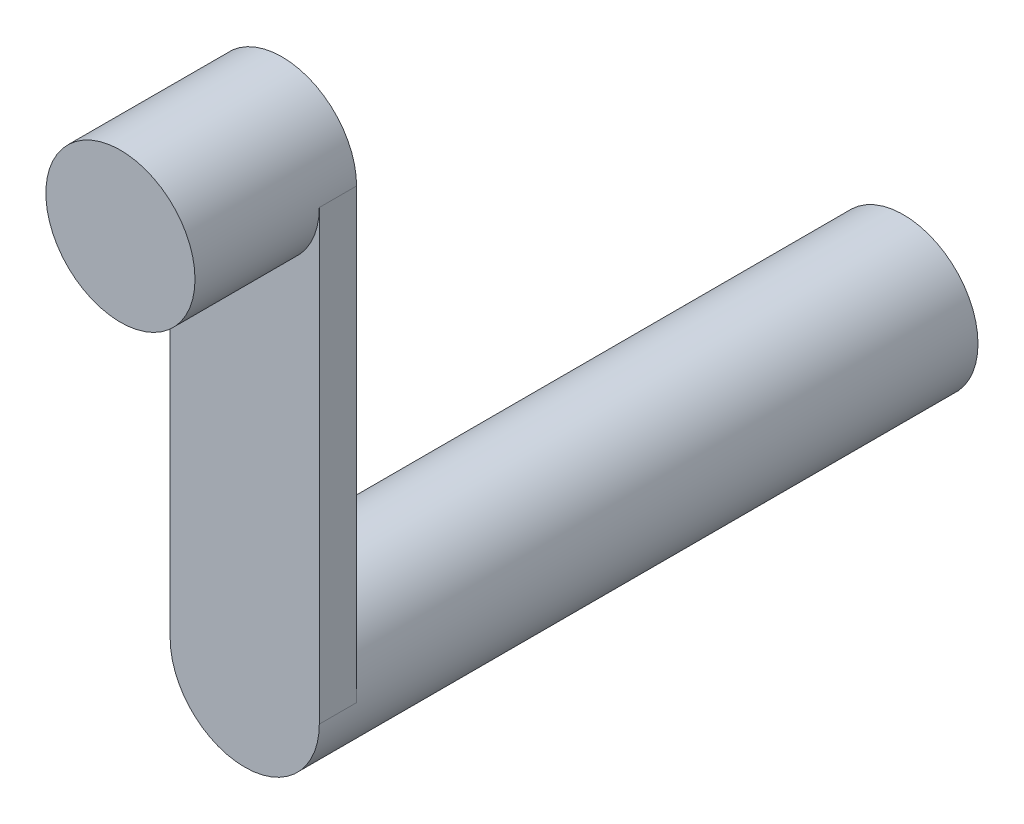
ISO-10303-21;
HEADER;
FILE_DESCRIPTION(('STEP AP214'),'2;1');
FILE_NAME('part.step','',(''),(''),'','','');
FILE_SCHEMA(('AUTOMOTIVE_DESIGN { 1 0 10303 214 1 1 1 1 }'));
ENDSEC;
DATA;
#1=APPLICATION_CONTEXT('core data for automotive mechanical design processes');
#2=APPLICATION_PROTOCOL_DEFINITION('international standard','automotive_design',2000,#1);
#3=PRODUCT_CONTEXT('',#1,'mechanical');
#4=PRODUCT('Part','Part','',(#3));
#5=PRODUCT_RELATED_PRODUCT_CATEGORY('part','',(#4));
#6=PRODUCT_DEFINITION_FORMATION('','',#4);
#7=PRODUCT_DEFINITION_CONTEXT('part definition',#1,'design');
#8=PRODUCT_DEFINITION('design','',#6,#7);
#9=PRODUCT_DEFINITION_SHAPE('','',#8);
#10=(LENGTH_UNIT() NAMED_UNIT(*) SI_UNIT(.MILLI.,.METRE.));
#11=(NAMED_UNIT(*) PLANE_ANGLE_UNIT() SI_UNIT($,.RADIAN.));
#12=(NAMED_UNIT(*) SI_UNIT($,.STERADIAN.) SOLID_ANGLE_UNIT());
#13=UNCERTAINTY_MEASURE_WITH_UNIT(LENGTH_MEASURE(1.E-05),#10,'distance_accuracy_value','');
#14=(GEOMETRIC_REPRESENTATION_CONTEXT(3) GLOBAL_UNCERTAINTY_ASSIGNED_CONTEXT((#13)) GLOBAL_UNIT_ASSIGNED_CONTEXT((#10,
#11,#12)) REPRESENTATION_CONTEXT('',''));
#15=CARTESIAN_POINT('',(0.,0.,0.));
#16=DIRECTION('',(0.,0.,1.));
#17=DIRECTION('',(1.,0.,0.));
#18=AXIS2_PLACEMENT_3D('',#15,#16,#17);
#19=CARTESIAN_POINT('',(0.,0.,50.));
#20=DIRECTION('',(0.,0.,-1.));
#21=DIRECTION('',(-1.,0.,0.));
#22=AXIS2_PLACEMENT_3D('',#19,#20,#21);
#23=CYLINDRICAL_SURFACE('',#22,6.);
#24=CARTESIAN_POINT('',(0.,0.,50.));
#25=DIRECTION('',(0.,0.,1.));
#26=DIRECTION('',(1.,0.,0.));
#27=AXIS2_PLACEMENT_3D('',#24,#25,#26);
#28=CIRCLE('',#27,6.);
#29=CARTESIAN_POINT('',(6.,0.,50.));
#30=VERTEX_POINT('',#29);
#31=CARTESIAN_POINT('',(-6.,0.,50.));
#32=VERTEX_POINT('',#31);
#33=EDGE_CURVE('E44',#30,#32,#28,.T.);
#34=ORIENTED_EDGE('',*,*,#33,.F.);
#35=DIRECTION('',(0.,0.,-1.));
#36=VECTOR('',#35,1.);
#37=CARTESIAN_POINT('',(6.,0.,53.));
#38=LINE('',#37,#36);
#39=CARTESIAN_POINT('',(6.,0.,53.));
#40=VERTEX_POINT('',#39);
#41=EDGE_CURVE('E86',#40,#30,#38,.T.);
#42=ORIENTED_EDGE('',*,*,#41,.F.);
#43=CARTESIAN_POINT('',(0.,0.,53.));
#44=DIRECTION('',(0.,0.,1.));
#45=DIRECTION('',(1.,0.,0.));
#46=AXIS2_PLACEMENT_3D('',#43,#44,#45);
#47=CIRCLE('',#46,6.);
#48=CARTESIAN_POINT('',(-6.,0.,53.));
#49=VERTEX_POINT('',#48);
#50=EDGE_CURVE('E59',#49,#40,#47,.T.);
#51=ORIENTED_EDGE('',*,*,#50,.F.);
#52=DIRECTION('',(0.,0.,-1.));
#53=VECTOR('',#52,1.);
#54=CARTESIAN_POINT('',(-6.,0.,53.));
#55=LINE('',#54,#53);
#56=EDGE_CURVE('E99',#49,#32,#55,.T.);
#57=ORIENTED_EDGE('',*,*,#56,.T.);
#58=EDGE_LOOP('',(#34,#42,#51,#57));
#59=FACE_BOUND('',#58,.T.);
#60=CARTESIAN_POINT('',(0.,0.,0.));
#61=DIRECTION('',(0.,0.,1.));
#62=DIRECTION('',(1.,0.,0.));
#63=AXIS2_PLACEMENT_3D('',#60,#61,#62);
#64=CIRCLE('',#63,6.);
#65=CARTESIAN_POINT('',(6.,0.,0.));
#66=VERTEX_POINT('',#65);
#67=EDGE_CURVE('E98',#66,#66,#64,.T.);
#68=ORIENTED_EDGE('',*,*,#67,.T.);
#69=EDGE_LOOP('',(#68));
#70=FACE_BOUND('',#69,.T.);
#71=ADVANCED_FACE('F36',(#59,#70),#23,.T.);
#72=CARTESIAN_POINT('',(0.,0.,0.));
#73=DIRECTION('',(0.,0.,1.));
#74=DIRECTION('',(1.,0.,0.));
#75=AXIS2_PLACEMENT_3D('',#72,#73,#74);
#76=PLANE('',#75);
#77=ORIENTED_EDGE('',*,*,#67,.F.);
#78=EDGE_LOOP('',(#77));
#79=FACE_BOUND('',#78,.T.);
#80=ADVANCED_FACE('F147',(#79),#76,.F.);
#81=CARTESIAN_POINT('',(0.,36.,50.));
#82=DIRECTION('',(0.,0.,1.));
#83=DIRECTION('',(1.,0.,0.));
#84=AXIS2_PLACEMENT_3D('',#81,#82,#83);
#85=PLANE('',#84);
#86=DIRECTION('',(0.,1.,0.));
#87=VECTOR('',#86,1.);
#88=CARTESIAN_POINT('',(6.,36.,50.));
#89=LINE('',#88,#87);
#90=CARTESIAN_POINT('',(6.,36.,50.));
#91=VERTEX_POINT('',#90);
#92=EDGE_CURVE('E82',#30,#91,#89,.T.);
#93=ORIENTED_EDGE('',*,*,#92,.F.);
#94=ORIENTED_EDGE('',*,*,#33,.T.);
#95=DIRECTION('',(0.,-1.,0.));
#96=VECTOR('',#95,1.);
#97=CARTESIAN_POINT('',(-6.,36.,50.));
#98=LINE('',#97,#96);
#99=CARTESIAN_POINT('',(-6.,36.,50.));
#100=VERTEX_POINT('',#99);
#101=EDGE_CURVE('E120',#100,#32,#98,.T.);
#102=ORIENTED_EDGE('',*,*,#101,.F.);
#103=CARTESIAN_POINT('',(0.,36.,50.));
#104=DIRECTION('',(0.,0.,1.));
#105=DIRECTION('',(1.,0.,0.));
#106=AXIS2_PLACEMENT_3D('',#103,#104,#105);
#107=CIRCLE('',#106,6.);
#108=EDGE_CURVE('E96',#91,#100,#107,.T.);
#109=ORIENTED_EDGE('',*,*,#108,.F.);
#110=EDGE_LOOP('',(#93,#94,#102,#109));
#111=FACE_BOUND('',#110,.T.);
#112=ADVANCED_FACE('F140',(#111),#85,.F.);
#113=CARTESIAN_POINT('',(0.,36.,53.));
#114=DIRECTION('',(0.,0.,-1.));
#115=DIRECTION('',(-1.,0.,0.));
#116=AXIS2_PLACEMENT_3D('',#113,#114,#115);
#117=CYLINDRICAL_SURFACE('',#116,6.);
#118=ORIENTED_EDGE('',*,*,#108,.T.);
#119=DIRECTION('',(0.,0.,-1.));
#120=VECTOR('',#119,1.);
#121=CARTESIAN_POINT('',(-6.,36.,53.));
#122=LINE('',#121,#120);
#123=CARTESIAN_POINT('',(-6.,36.,53.));
#124=VERTEX_POINT('',#123);
#125=EDGE_CURVE('E95',#124,#100,#122,.T.);
#126=ORIENTED_EDGE('',*,*,#125,.F.);
#127=CARTESIAN_POINT('',(0.,36.,53.));
#128=DIRECTION('',(0.,0.,1.));
#129=DIRECTION('',(1.,0.,0.));
#130=AXIS2_PLACEMENT_3D('',#127,#128,#129);
#131=CIRCLE('',#130,6.);
#132=CARTESIAN_POINT('',(6.,36.,53.));
#133=VERTEX_POINT('',#132);
#134=EDGE_CURVE('E11',#124,#133,#131,.T.);
#135=ORIENTED_EDGE('',*,*,#134,.T.);
#136=DIRECTION('',(0.,0.,-1.));
#137=VECTOR('',#136,1.);
#138=CARTESIAN_POINT('',(6.,36.,53.));
#139=LINE('',#138,#137);
#140=EDGE_CURVE('E78',#133,#91,#139,.T.);
#141=ORIENTED_EDGE('',*,*,#140,.T.);
#142=EDGE_LOOP('',(#118,#126,#135,#141));
#143=FACE_BOUND('',#142,.T.);
#144=CARTESIAN_POINT('',(0.,36.,63.));
#145=DIRECTION('',(0.,0.,1.));
#146=DIRECTION('',(1.,0.,0.));
#147=AXIS2_PLACEMENT_3D('',#144,#145,#146);
#148=CIRCLE('',#147,6.);
#149=CARTESIAN_POINT('',(6.,36.,63.));
#150=VERTEX_POINT('',#149);
#151=EDGE_CURVE('E133',#150,#150,#148,.T.);
#152=ORIENTED_EDGE('',*,*,#151,.F.);
#153=EDGE_LOOP('',(#152));
#154=FACE_BOUND('',#153,.T.);
#155=ADVANCED_FACE('F92',(#143,#154),#117,.T.);
#156=CARTESIAN_POINT('',(-6.,36.,53.));
#157=DIRECTION('',(1.,0.,0.));
#158=DIRECTION('',(0.,0.,-1.));
#159=AXIS2_PLACEMENT_3D('',#156,#157,#158);
#160=PLANE('',#159);
#161=ORIENTED_EDGE('',*,*,#101,.T.);
#162=ORIENTED_EDGE('',*,*,#56,.F.);
#163=DIRECTION('',(0.,-1.,0.));
#164=VECTOR('',#163,1.);
#165=CARTESIAN_POINT('',(-6.,36.,53.));
#166=LINE('',#165,#164);
#167=EDGE_CURVE('E108',#124,#49,#166,.T.);
#168=ORIENTED_EDGE('',*,*,#167,.F.);
#169=ORIENTED_EDGE('',*,*,#125,.T.);
#170=EDGE_LOOP('',(#161,#162,#168,#169));
#171=FACE_BOUND('',#170,.T.);
#172=ADVANCED_FACE('F139',(#171),#160,.F.);
#173=CARTESIAN_POINT('',(6.,36.,53.));
#174=DIRECTION('',(-1.,0.,0.));
#175=DIRECTION('',(0.,0.,1.));
#176=AXIS2_PLACEMENT_3D('',#173,#174,#175);
#177=PLANE('',#176);
#178=ORIENTED_EDGE('',*,*,#92,.T.);
#179=ORIENTED_EDGE('',*,*,#140,.F.);
#180=DIRECTION('',(0.,1.,0.));
#181=VECTOR('',#180,1.);
#182=CARTESIAN_POINT('',(6.,36.,53.));
#183=LINE('',#182,#181);
#184=EDGE_CURVE('E81',#40,#133,#183,.T.);
#185=ORIENTED_EDGE('',*,*,#184,.F.);
#186=ORIENTED_EDGE('',*,*,#41,.T.);
#187=EDGE_LOOP('',(#178,#179,#185,#186));
#188=FACE_BOUND('',#187,.T.);
#189=ADVANCED_FACE('F79',(#188),#177,.F.);
#190=CARTESIAN_POINT('',(0.,36.,53.));
#191=DIRECTION('',(0.,0.,1.));
#192=DIRECTION('',(1.,0.,0.));
#193=AXIS2_PLACEMENT_3D('',#190,#191,#192);
#194=PLANE('',#193);
#195=ORIENTED_EDGE('',*,*,#134,.F.);
#196=ORIENTED_EDGE('',*,*,#167,.T.);
#197=ORIENTED_EDGE('',*,*,#50,.T.);
#198=ORIENTED_EDGE('',*,*,#184,.T.);
#199=EDGE_LOOP('',(#195,#196,#197,#198));
#200=FACE_BOUND('',#199,.T.);
#201=ADVANCED_FACE('F88',(#200),#194,.T.);
#202=CARTESIAN_POINT('',(0.,36.,63.));
#203=DIRECTION('',(0.,0.,1.));
#204=DIRECTION('',(1.,0.,0.));
#205=AXIS2_PLACEMENT_3D('',#202,#203,#204);
#206=PLANE('',#205);
#207=ORIENTED_EDGE('',*,*,#151,.T.);
#208=EDGE_LOOP('',(#207));
#209=FACE_BOUND('',#208,.T.);
#210=ADVANCED_FACE('F137',(#209),#206,.T.);
#211=CLOSED_SHELL('',(#71,#80,#112,#155,#172,#189,#201,#210));
#212=MANIFOLD_SOLID_BREP('B2',#211);
#213=ADVANCED_BREP_SHAPE_REPRESENTATION('',(#18,#212),#14);
#214=SHAPE_DEFINITION_REPRESENTATION(#9,#213);
ENDSEC;
END-ISO-10303-21;
